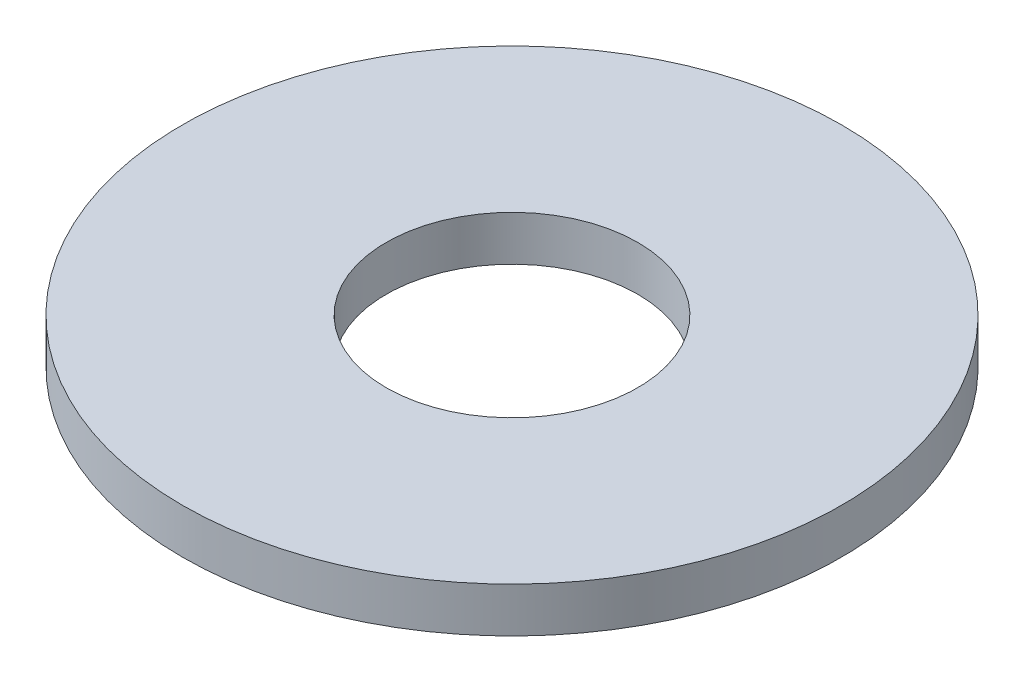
from build123d import *

# Parameters (mm, degrees)
ESQUISSE1_R      = 11
ESQUISSE1_R_2    = 4.2
EXTRUSION1_DEPTH = 1.5


with BuildPart() as part:
    # Esquisse1 → Extrusion1 (new body)
    with BuildSketch(Plane(origin=(0, 0, 0), x_dir=(1, 0, 0), z_dir=(0, 1, 0))):
        with Locations(Location((0, 0, 0), (0, 0, 270))):
            Circle(ESQUISSE1_R)
        with Locations(Location((0, 0, 0), (0, 0, 270))):
            Circle(ESQUISSE1_R_2, mode=Mode.SUBTRACT)
    extrude(amount=EXTRUSION1_DEPTH)


solid = part.part
